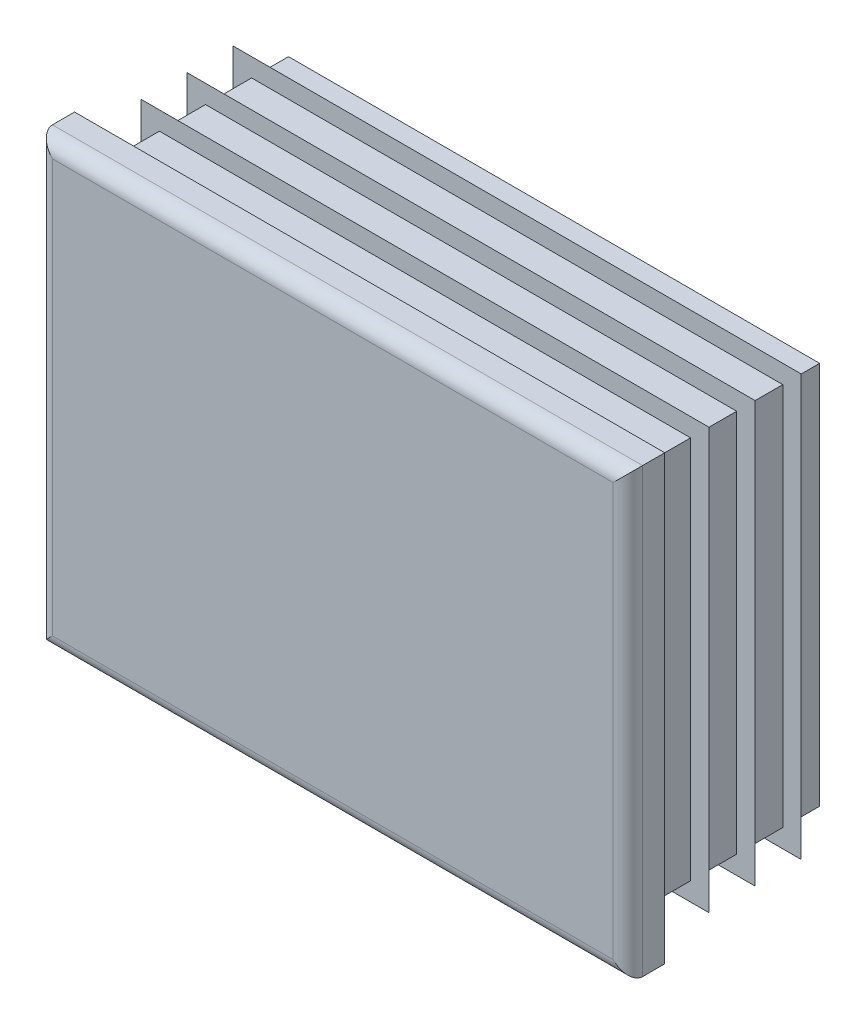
ISO-10303-21;
HEADER;
FILE_DESCRIPTION(('STEP AP214'),'2;1');
FILE_NAME('part.step','',(''),(''),'','','');
FILE_SCHEMA(('AUTOMOTIVE_DESIGN { 1 0 10303 214 1 1 1 1 }'));
ENDSEC;
DATA;
#1=APPLICATION_CONTEXT('core data for automotive mechanical design processes');
#2=APPLICATION_PROTOCOL_DEFINITION('international standard','automotive_design',2000,#1);
#3=PRODUCT_CONTEXT('',#1,'mechanical');
#4=PRODUCT('Part','Part','',(#3));
#5=PRODUCT_RELATED_PRODUCT_CATEGORY('part','',(#4));
#6=PRODUCT_DEFINITION_FORMATION('','',#4);
#7=PRODUCT_DEFINITION_CONTEXT('part definition',#1,'design');
#8=PRODUCT_DEFINITION('design','',#6,#7);
#9=PRODUCT_DEFINITION_SHAPE('','',#8);
#10=(LENGTH_UNIT() NAMED_UNIT(*) SI_UNIT(.MILLI.,.METRE.));
#11=(NAMED_UNIT(*) PLANE_ANGLE_UNIT() SI_UNIT($,.RADIAN.));
#12=(NAMED_UNIT(*) SI_UNIT($,.STERADIAN.) SOLID_ANGLE_UNIT());
#13=UNCERTAINTY_MEASURE_WITH_UNIT(LENGTH_MEASURE(1.E-05),#10,'distance_accuracy_value','');
#14=(GEOMETRIC_REPRESENTATION_CONTEXT(3) GLOBAL_UNCERTAINTY_ASSIGNED_CONTEXT((#13)) GLOBAL_UNIT_ASSIGNED_CONTEXT((#10,
#11,#12)) REPRESENTATION_CONTEXT('',''));
#15=CARTESIAN_POINT('',(0.,0.,0.));
#16=DIRECTION('',(0.,0.,1.));
#17=DIRECTION('',(1.,0.,0.));
#18=AXIS2_PLACEMENT_3D('',#15,#16,#17);
#19=CARTESIAN_POINT('',(38.,-30.,5.));
#20=DIRECTION('',(0.,0.,-1.));
#21=DIRECTION('',(0.,1.,0.));
#22=AXIS2_PLACEMENT_3D('',#19,#20,#21);
#23=PLANE('',#22);
#24=DIRECTION('',(0.,1.,0.));
#25=VECTOR('',#24,1.);
#26=CARTESIAN_POINT('',(-38.,-30.,5.));
#27=LINE('',#26,#25);
#28=CARTESIAN_POINT('',(-38.,-28.,5.));
#29=VERTEX_POINT('',#28);
#30=CARTESIAN_POINT('',(-38.,28.,5.));
#31=VERTEX_POINT('',#30);
#32=EDGE_CURVE('E310',#29,#31,#27,.T.);
#33=ORIENTED_EDGE('',*,*,#32,.F.);
#34=DIRECTION('',(-1.,0.,0.));
#35=VECTOR('',#34,1.);
#36=CARTESIAN_POINT('',(40.,-28.,5.));
#37=LINE('',#36,#35);
#38=CARTESIAN_POINT('',(38.,-28.,5.));
#39=VERTEX_POINT('',#38);
#40=EDGE_CURVE('E482',#39,#29,#37,.T.);
#41=ORIENTED_EDGE('',*,*,#40,.F.);
#42=DIRECTION('',(0.,1.,0.));
#43=VECTOR('',#42,1.);
#44=CARTESIAN_POINT('',(38.,-30.,5.));
#45=LINE('',#44,#43);
#46=CARTESIAN_POINT('',(38.,28.,5.));
#47=VERTEX_POINT('',#46);
#48=EDGE_CURVE('E305',#39,#47,#45,.T.);
#49=ORIENTED_EDGE('',*,*,#48,.T.);
#50=DIRECTION('',(-1.,0.,0.));
#51=VECTOR('',#50,1.);
#52=CARTESIAN_POINT('',(40.,28.,5.));
#53=LINE('',#52,#51);
#54=EDGE_CURVE('E630',#47,#31,#53,.T.);
#55=ORIENTED_EDGE('',*,*,#54,.T.);
#56=EDGE_LOOP('',(#33,#41,#49,#55));
#57=FACE_BOUND('',#56,.T.);
#58=ADVANCED_FACE('F14',(#57),#23,.F.);
#59=CARTESIAN_POINT('',(-38.,-30.,3.));
#60=DIRECTION('',(0.,1.,0.));
#61=DIRECTION('',(-1.,0.,0.));
#62=AXIS2_PLACEMENT_3D('',#59,#60,#61);
#63=CYLINDRICAL_SURFACE('',#62,2.);
#64=DIRECTION('',(0.,1.,0.));
#65=VECTOR('',#64,1.);
#66=CARTESIAN_POINT('',(-40.,-30.,3.));
#67=LINE('',#66,#65);
#68=CARTESIAN_POINT('',(-40.,-30.,3.));
#69=VERTEX_POINT('',#68);
#70=CARTESIAN_POINT('',(-40.,30.,3.));
#71=VERTEX_POINT('',#70);
#72=EDGE_CURVE('E402',#69,#71,#67,.T.);
#73=ORIENTED_EDGE('',*,*,#72,.F.);
#74=CARTESIAN_POINT('',(-38.,-28.,3.));
#75=DIRECTION('',(-0.707106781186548,0.707106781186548,0.));
#76=DIRECTION('',(0.707106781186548,0.707106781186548,0.));
#77=AXIS2_PLACEMENT_3D('',#74,#75,#76);
#78=ELLIPSE('',#77,2.82842712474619,2.);
#79=EDGE_CURVE('E59',#69,#29,#78,.T.);
#80=ORIENTED_EDGE('',*,*,#79,.T.);
#81=ORIENTED_EDGE('',*,*,#32,.T.);
#82=CARTESIAN_POINT('',(-38.,28.,3.));
#83=DIRECTION('',(0.707106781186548,0.707106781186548,0.));
#84=DIRECTION('',(-0.707106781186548,0.707106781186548,0.));
#85=AXIS2_PLACEMENT_3D('',#82,#83,#84);
#86=ELLIPSE('',#85,2.82842712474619,2.);
#87=EDGE_CURVE('E306',#31,#71,#86,.F.);
#88=ORIENTED_EDGE('',*,*,#87,.T.);
#89=EDGE_LOOP('',(#73,#80,#81,#88));
#90=FACE_BOUND('',#89,.T.);
#91=ADVANCED_FACE('F16',(#90),#63,.T.);
#92=CARTESIAN_POINT('',(-40.,-30.,3.));
#93=DIRECTION('',(1.,0.,0.));
#94=DIRECTION('',(0.,1.,0.));
#95=AXIS2_PLACEMENT_3D('',#92,#93,#94);
#96=PLANE('',#95);
#97=DIRECTION('',(0.,0.,-1.));
#98=VECTOR('',#97,1.);
#99=CARTESIAN_POINT('',(-40.,30.,3.));
#100=LINE('',#99,#98);
#101=CARTESIAN_POINT('',(-40.,30.,0.));
#102=VERTEX_POINT('',#101);
#103=EDGE_CURVE('E615',#71,#102,#100,.T.);
#104=ORIENTED_EDGE('',*,*,#103,.T.);
#105=DIRECTION('',(0.,1.,0.));
#106=VECTOR('',#105,1.);
#107=CARTESIAN_POINT('',(-40.,-30.,0.));
#108=LINE('',#107,#106);
#109=CARTESIAN_POINT('',(-40.,-30.,0.));
#110=VERTEX_POINT('',#109);
#111=EDGE_CURVE('E400',#110,#102,#108,.T.);
#112=ORIENTED_EDGE('',*,*,#111,.F.);
#113=DIRECTION('',(0.,0.,-1.));
#114=VECTOR('',#113,1.);
#115=CARTESIAN_POINT('',(-40.,-30.,3.));
#116=LINE('',#115,#114);
#117=EDGE_CURVE('E616',#69,#110,#116,.T.);
#118=ORIENTED_EDGE('',*,*,#117,.F.);
#119=ORIENTED_EDGE('',*,*,#72,.T.);
#120=EDGE_LOOP('',(#104,#112,#118,#119));
#121=FACE_BOUND('',#120,.T.);
#122=ADVANCED_FACE('F697',(#121),#96,.F.);
#123=CARTESIAN_POINT('',(-36.,-30.,0.));
#124=DIRECTION('',(1.,0.,0.));
#125=DIRECTION('',(0.,1.,0.));
#126=AXIS2_PLACEMENT_3D('',#123,#124,#125);
#127=PLANE('',#126);
#128=DIRECTION('',(0.,1.,0.));
#129=VECTOR('',#128,1.);
#130=CARTESIAN_POINT('',(-36.,-30.,0.));
#131=LINE('',#130,#129);
#132=CARTESIAN_POINT('',(-36.,-26.,0.));
#133=VERTEX_POINT('',#132);
#134=CARTESIAN_POINT('',(-36.,26.,0.));
#135=VERTEX_POINT('',#134);
#136=EDGE_CURVE('E397',#133,#135,#131,.T.);
#137=ORIENTED_EDGE('',*,*,#136,.T.);
#138=DIRECTION('',(0.,0.,-1.));
#139=VECTOR('',#138,1.);
#140=CARTESIAN_POINT('',(-36.,26.,0.));
#141=LINE('',#140,#139);
#142=CARTESIAN_POINT('',(-36.,26.,-1.25));
#143=VERTEX_POINT('',#142);
#144=EDGE_CURVE('E495',#135,#143,#141,.T.);
#145=ORIENTED_EDGE('',*,*,#144,.T.);
#146=DIRECTION('',(0.,1.,0.));
#147=VECTOR('',#146,1.);
#148=CARTESIAN_POINT('',(-36.,-30.,-1.25));
#149=LINE('',#148,#147);
#150=CARTESIAN_POINT('',(-36.,-26.,-1.25));
#151=VERTEX_POINT('',#150);
#152=EDGE_CURVE('E394',#151,#143,#149,.T.);
#153=ORIENTED_EDGE('',*,*,#152,.F.);
#154=DIRECTION('',(0.,0.,1.));
#155=VECTOR('',#154,1.);
#156=CARTESIAN_POINT('',(-36.,-26.,0.));
#157=LINE('',#156,#155);
#158=EDGE_CURVE('E489',#151,#133,#157,.T.);
#159=ORIENTED_EDGE('',*,*,#158,.T.);
#160=EDGE_LOOP('',(#137,#145,#153,#159));
#161=FACE_BOUND('',#160,.T.);
#162=ADVANCED_FACE('F787',(#161),#127,.F.);
#163=CARTESIAN_POINT('',(-38.5,-30.,-1.25));
#164=DIRECTION('',(0.342020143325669,0.,0.939692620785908));
#165=DIRECTION('',(-0.939692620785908,0.,0.342020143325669));
#166=AXIS2_PLACEMENT_3D('',#163,#164,#165);
#167=PLANE('',#166);
#168=DIRECTION('',(0.,1.,0.));
#169=VECTOR('',#168,1.);
#170=CARTESIAN_POINT('',(-38.5,-30.,-1.25));
#171=LINE('',#170,#169);
#172=CARTESIAN_POINT('',(-38.5,-28.5,-1.25));
#173=VERTEX_POINT('',#172);
#174=CARTESIAN_POINT('',(-38.5,28.5,-1.25));
#175=VERTEX_POINT('',#174);
#176=EDGE_CURVE('E392',#173,#175,#171,.T.);
#177=ORIENTED_EDGE('',*,*,#176,.T.);
#178=DIRECTION('',(0.844349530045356,-0.438895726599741,-0.307318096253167));
#179=VECTOR('',#178,1.);
#180=CARTESIAN_POINT('',(-16.8209880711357,17.2311766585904,-9.14051505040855));
#181=LINE('',#180,#179);
#182=CARTESIAN_POINT('',(-36.,27.2004915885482,-2.1599255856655));
#183=VERTEX_POINT('',#182);
#184=EDGE_CURVE('E519',#175,#183,#181,.T.);
#185=ORIENTED_EDGE('',*,*,#184,.T.);
#186=DIRECTION('',(0.,1.,0.));
#187=VECTOR('',#186,1.);
#188=CARTESIAN_POINT('',(-36.,-30.,-2.1599255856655));
#189=LINE('',#188,#187);
#190=CARTESIAN_POINT('',(-36.,-27.2004915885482,-2.1599255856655));
#191=VERTEX_POINT('',#190);
#192=EDGE_CURVE('E389',#191,#183,#189,.T.);
#193=ORIENTED_EDGE('',*,*,#192,.F.);
#194=DIRECTION('',(-0.844349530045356,-0.438895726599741,0.307318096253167));
#195=VECTOR('',#194,1.);
#196=CARTESIAN_POINT('',(-39.0558721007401,-28.7889441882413,-1.04767910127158));
#197=LINE('',#196,#195);
#198=EDGE_CURVE('E507',#191,#173,#197,.T.);
#199=ORIENTED_EDGE('',*,*,#198,.T.);
#200=EDGE_LOOP('',(#177,#185,#193,#199));
#201=FACE_BOUND('',#200,.T.);
#202=ADVANCED_FACE('F783',(#201),#167,.F.);
#203=CARTESIAN_POINT('',(-36.,-30.,-2.1599255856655));
#204=DIRECTION('',(1.,0.,0.));
#205=DIRECTION('',(0.,1.,0.));
#206=AXIS2_PLACEMENT_3D('',#203,#204,#205);
#207=PLANE('',#206);
#208=ORIENTED_EDGE('',*,*,#192,.T.);
#209=DIRECTION('',(0.,-0.819152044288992,-0.573576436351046));
#210=VECTOR('',#209,1.);
#211=CARTESIAN_POINT('',(-36.,-11.1816143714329,-29.0353655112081));
#212=LINE('',#211,#210);
#213=CARTESIAN_POINT('',(-36.,26.,-3.00051884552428));
#214=VERTEX_POINT('',#213);
#215=EDGE_CURVE('E516',#183,#214,#212,.T.);
#216=ORIENTED_EDGE('',*,*,#215,.T.);
#217=DIRECTION('',(0.,0.,-1.));
#218=VECTOR('',#217,1.);
#219=CARTESIAN_POINT('',(-36.,26.,-2.1599255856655));
#220=LINE('',#219,#218);
#221=CARTESIAN_POINT('',(-36.,26.,-7.5));
#222=VERTEX_POINT('',#221);
#223=EDGE_CURVE('E525',#214,#222,#220,.T.);
#224=ORIENTED_EDGE('',*,*,#223,.T.);
#225=DIRECTION('',(0.,1.,0.));
#226=VECTOR('',#225,1.);
#227=CARTESIAN_POINT('',(-36.,-30.,-7.5));
#228=LINE('',#227,#226);
#229=CARTESIAN_POINT('',(-36.,-26.,-7.5));
#230=VERTEX_POINT('',#229);
#231=EDGE_CURVE('E386',#230,#222,#228,.T.);
#232=ORIENTED_EDGE('',*,*,#231,.F.);
#233=DIRECTION('',(0.,0.,1.));
#234=VECTOR('',#233,1.);
#235=CARTESIAN_POINT('',(-36.,-26.,-2.1599255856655));
#236=LINE('',#235,#234);
#237=CARTESIAN_POINT('',(-36.,-26.,-3.00051884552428));
#238=VERTEX_POINT('',#237);
#239=EDGE_CURVE('E522',#230,#238,#236,.T.);
#240=ORIENTED_EDGE('',*,*,#239,.T.);
#241=DIRECTION('',(0.,-0.819152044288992,0.573576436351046));
#242=VECTOR('',#241,1.);
#243=CARTESIAN_POINT('',(-36.,-29.0789899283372,-0.844586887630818));
#244=LINE('',#243,#242);
#245=EDGE_CURVE('E504',#238,#191,#244,.T.);
#246=ORIENTED_EDGE('',*,*,#245,.T.);
#247=EDGE_LOOP('',(#208,#216,#224,#232,#240,#246));
#248=FACE_BOUND('',#247,.T.);
#249=ADVANCED_FACE('F779',(#248),#207,.F.);
#250=CARTESIAN_POINT('',(-38.5,-30.,-7.5));
#251=DIRECTION('',(0.342020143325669,0.,0.939692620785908));
#252=DIRECTION('',(-0.939692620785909,0.,0.342020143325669));
#253=AXIS2_PLACEMENT_3D('',#250,#251,#252);
#254=PLANE('',#253);
#255=DIRECTION('',(0.,1.,0.));
#256=VECTOR('',#255,1.);
#257=CARTESIAN_POINT('',(-38.5,-30.,-7.5));
#258=LINE('',#257,#256);
#259=CARTESIAN_POINT('',(-38.5,-28.5,-7.5));
#260=VERTEX_POINT('',#259);
#261=CARTESIAN_POINT('',(-38.5,28.5,-7.5));
#262=VERTEX_POINT('',#261);
#263=EDGE_CURVE('E384',#260,#262,#258,.T.);
#264=ORIENTED_EDGE('',*,*,#263,.T.);
#265=DIRECTION('',(0.844349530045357,-0.438895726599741,-0.307318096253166));
#266=VECTOR('',#265,1.);
#267=CARTESIAN_POINT('',(-16.8209880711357,17.2311766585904,-15.3905150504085));
#268=LINE('',#267,#266);
#269=CARTESIAN_POINT('',(-36.,27.2004915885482,-8.40992558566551));
#270=VERTEX_POINT('',#269);
#271=EDGE_CURVE('E549',#262,#270,#268,.T.);
#272=ORIENTED_EDGE('',*,*,#271,.T.);
#273=DIRECTION('',(0.,1.,0.));
#274=VECTOR('',#273,1.);
#275=CARTESIAN_POINT('',(-36.,-30.,-8.4099255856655));
#276=LINE('',#275,#274);
#277=CARTESIAN_POINT('',(-36.,-27.2004915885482,-8.4099255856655));
#278=VERTEX_POINT('',#277);
#279=EDGE_CURVE('E381',#278,#270,#276,.T.);
#280=ORIENTED_EDGE('',*,*,#279,.F.);
#281=DIRECTION('',(-0.844349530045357,-0.438895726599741,0.307318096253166));
#282=VECTOR('',#281,1.);
#283=CARTESIAN_POINT('',(-39.0558721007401,-28.7889441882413,-7.29767910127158));
#284=LINE('',#283,#282);
#285=EDGE_CURVE('E537',#278,#260,#284,.T.);
#286=ORIENTED_EDGE('',*,*,#285,.T.);
#287=EDGE_LOOP('',(#264,#272,#280,#286));
#288=FACE_BOUND('',#287,.T.);
#289=ADVANCED_FACE('F775',(#288),#254,.F.);
#290=CARTESIAN_POINT('',(-36.,-30.,-8.4099255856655));
#291=DIRECTION('',(1.,0.,0.));
#292=DIRECTION('',(0.,1.,0.));
#293=AXIS2_PLACEMENT_3D('',#290,#291,#292);
#294=PLANE('',#293);
#295=ORIENTED_EDGE('',*,*,#279,.T.);
#296=DIRECTION('',(0.,-0.819152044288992,-0.573576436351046));
#297=VECTOR('',#296,1.);
#298=CARTESIAN_POINT('',(-36.,-11.1816143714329,-35.285365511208));
#299=LINE('',#298,#297);
#300=CARTESIAN_POINT('',(-36.,26.,-9.25051884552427));
#301=VERTEX_POINT('',#300);
#302=EDGE_CURVE('E546',#270,#301,#299,.T.);
#303=ORIENTED_EDGE('',*,*,#302,.T.);
#304=DIRECTION('',(0.,0.,-1.));
#305=VECTOR('',#304,1.);
#306=CARTESIAN_POINT('',(-36.,26.,-8.4099255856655));
#307=LINE('',#306,#305);
#308=CARTESIAN_POINT('',(-36.,26.,-13.75));
#309=VERTEX_POINT('',#308);
#310=EDGE_CURVE('E555',#301,#309,#307,.T.);
#311=ORIENTED_EDGE('',*,*,#310,.T.);
#312=DIRECTION('',(0.,1.,0.));
#313=VECTOR('',#312,1.);
#314=CARTESIAN_POINT('',(-36.,-30.,-13.75));
#315=LINE('',#314,#313);
#316=CARTESIAN_POINT('',(-36.,-26.,-13.75));
#317=VERTEX_POINT('',#316);
#318=EDGE_CURVE('E378',#317,#309,#315,.T.);
#319=ORIENTED_EDGE('',*,*,#318,.F.);
#320=DIRECTION('',(0.,0.,1.));
#321=VECTOR('',#320,1.);
#322=CARTESIAN_POINT('',(-36.,-26.,-8.4099255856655));
#323=LINE('',#322,#321);
#324=CARTESIAN_POINT('',(-36.,-26.,-9.25051884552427));
#325=VERTEX_POINT('',#324);
#326=EDGE_CURVE('E552',#317,#325,#323,.T.);
#327=ORIENTED_EDGE('',*,*,#326,.T.);
#328=DIRECTION('',(0.,-0.819152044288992,0.573576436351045));
#329=VECTOR('',#328,1.);
#330=CARTESIAN_POINT('',(-36.,-29.0789899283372,-7.09458688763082));
#331=LINE('',#330,#329);
#332=EDGE_CURVE('E534',#325,#278,#331,.T.);
#333=ORIENTED_EDGE('',*,*,#332,.T.);
#334=EDGE_LOOP('',(#295,#303,#311,#319,#327,#333));
#335=FACE_BOUND('',#334,.T.);
#336=ADVANCED_FACE('F771',(#335),#294,.F.);
#337=CARTESIAN_POINT('',(-38.5,-30.,-13.75));
#338=DIRECTION('',(0.342020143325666,0.,0.939692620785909));
#339=DIRECTION('',(-0.939692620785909,0.,0.342020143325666));
#340=AXIS2_PLACEMENT_3D('',#337,#338,#339);
#341=PLANE('',#340);
#342=DIRECTION('',(0.,1.,0.));
#343=VECTOR('',#342,1.);
#344=CARTESIAN_POINT('',(-38.5,-30.,-13.75));
#345=LINE('',#344,#343);
#346=CARTESIAN_POINT('',(-38.5,-28.5,-13.75));
#347=VERTEX_POINT('',#346);
#348=CARTESIAN_POINT('',(-38.5,28.5,-13.75));
#349=VERTEX_POINT('',#348);
#350=EDGE_CURVE('E376',#347,#349,#345,.T.);
#351=ORIENTED_EDGE('',*,*,#350,.T.);
#352=DIRECTION('',(0.844349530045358,-0.438895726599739,-0.307318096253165));
#353=VECTOR('',#352,1.);
#354=CARTESIAN_POINT('',(-16.8209880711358,17.2311766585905,-21.6405150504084));
#355=LINE('',#354,#353);
#356=CARTESIAN_POINT('',(-36.,27.2004915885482,-14.6599255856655));
#357=VERTEX_POINT('',#356);
#358=EDGE_CURVE('E579',#349,#357,#355,.T.);
#359=ORIENTED_EDGE('',*,*,#358,.T.);
#360=DIRECTION('',(0.,1.,0.));
#361=VECTOR('',#360,1.);
#362=CARTESIAN_POINT('',(-36.,-30.,-14.6599255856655));
#363=LINE('',#362,#361);
#364=CARTESIAN_POINT('',(-36.,-27.2004915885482,-14.6599255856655));
#365=VERTEX_POINT('',#364);
#366=EDGE_CURVE('E373',#365,#357,#363,.T.);
#367=ORIENTED_EDGE('',*,*,#366,.F.);
#368=DIRECTION('',(-0.844349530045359,-0.438895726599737,0.307318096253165));
#369=VECTOR('',#368,1.);
#370=CARTESIAN_POINT('',(-39.0558721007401,-28.7889441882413,-13.5476791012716));
#371=LINE('',#370,#369);
#372=EDGE_CURVE('E567',#365,#347,#371,.T.);
#373=ORIENTED_EDGE('',*,*,#372,.T.);
#374=EDGE_LOOP('',(#351,#359,#367,#373));
#375=FACE_BOUND('',#374,.T.);
#376=ADVANCED_FACE('F767',(#375),#341,.F.);
#377=CARTESIAN_POINT('',(-36.,-30.,-14.6599255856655));
#378=DIRECTION('',(1.,0.,0.));
#379=DIRECTION('',(0.,1.,0.));
#380=AXIS2_PLACEMENT_3D('',#377,#378,#379);
#381=PLANE('',#380);
#382=ORIENTED_EDGE('',*,*,#366,.T.);
#383=DIRECTION('',(0.,-0.819152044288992,-0.573576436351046));
#384=VECTOR('',#383,1.);
#385=CARTESIAN_POINT('',(-36.,-11.1816143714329,-41.535365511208));
#386=LINE('',#385,#384);
#387=CARTESIAN_POINT('',(-36.,26.,-15.5005188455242));
#388=VERTEX_POINT('',#387);
#389=EDGE_CURVE('E576',#357,#388,#386,.T.);
#390=ORIENTED_EDGE('',*,*,#389,.T.);
#391=DIRECTION('',(0.,0.,-1.));
#392=VECTOR('',#391,1.);
#393=CARTESIAN_POINT('',(-36.,26.,-14.6599255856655));
#394=LINE('',#393,#392);
#395=CARTESIAN_POINT('',(-36.,26.,-20.));
#396=VERTEX_POINT('',#395);
#397=EDGE_CURVE('E585',#388,#396,#394,.T.);
#398=ORIENTED_EDGE('',*,*,#397,.T.);
#399=DIRECTION('',(0.,1.,0.));
#400=VECTOR('',#399,1.);
#401=CARTESIAN_POINT('',(-36.,-30.,-20.));
#402=LINE('',#401,#400);
#403=CARTESIAN_POINT('',(-36.,-26.,-20.));
#404=VERTEX_POINT('',#403);
#405=EDGE_CURVE('E370',#404,#396,#402,.T.);
#406=ORIENTED_EDGE('',*,*,#405,.F.);
#407=DIRECTION('',(0.,0.,1.));
#408=VECTOR('',#407,1.);
#409=CARTESIAN_POINT('',(-36.,-26.,-14.6599255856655));
#410=LINE('',#409,#408);
#411=CARTESIAN_POINT('',(-36.,-26.,-15.5005188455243));
#412=VERTEX_POINT('',#411);
#413=EDGE_CURVE('E582',#404,#412,#410,.T.);
#414=ORIENTED_EDGE('',*,*,#413,.T.);
#415=DIRECTION('',(0.,-0.819152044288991,0.573576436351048));
#416=VECTOR('',#415,1.);
#417=CARTESIAN_POINT('',(-36.,-29.0789899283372,-13.3445868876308));
#418=LINE('',#417,#416);
#419=EDGE_CURVE('E564',#412,#365,#418,.T.);
#420=ORIENTED_EDGE('',*,*,#419,.T.);
#421=EDGE_LOOP('',(#382,#390,#398,#406,#414,#420));
#422=FACE_BOUND('',#421,.T.);
#423=ADVANCED_FACE('F764',(#422),#381,.F.);
#424=CARTESIAN_POINT('',(-38.5,-30.,-20.));
#425=DIRECTION('',(0.342020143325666,0.,0.939692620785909));
#426=DIRECTION('',(-0.939692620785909,0.,0.342020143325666));
#427=AXIS2_PLACEMENT_3D('',#424,#425,#426);
#428=PLANE('',#427);
#429=DIRECTION('',(0.,1.,0.));
#430=VECTOR('',#429,1.);
#431=CARTESIAN_POINT('',(-38.5,-30.,-20.));
#432=LINE('',#431,#430);
#433=CARTESIAN_POINT('',(-38.5,-28.5,-20.));
#434=VERTEX_POINT('',#433);
#435=CARTESIAN_POINT('',(-38.5,28.5,-20.));
#436=VERTEX_POINT('',#435);
#437=EDGE_CURVE('E368',#434,#436,#432,.T.);
#438=ORIENTED_EDGE('',*,*,#437,.T.);
#439=DIRECTION('',(0.844349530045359,-0.438895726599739,-0.307318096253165));
#440=VECTOR('',#439,1.);
#441=CARTESIAN_POINT('',(-16.8209880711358,17.2311766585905,-27.8905150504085));
#442=LINE('',#441,#440);
#443=CARTESIAN_POINT('',(-36.,27.2004915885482,-20.9099255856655));
#444=VERTEX_POINT('',#443);
#445=EDGE_CURVE('E607',#436,#444,#442,.T.);
#446=ORIENTED_EDGE('',*,*,#445,.T.);
#447=DIRECTION('',(0.,1.,0.));
#448=VECTOR('',#447,1.);
#449=CARTESIAN_POINT('',(-36.,-30.,-20.9099255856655));
#450=LINE('',#449,#448);
#451=CARTESIAN_POINT('',(-36.,-27.2004915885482,-20.9099255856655));
#452=VERTEX_POINT('',#451);
#453=EDGE_CURVE('E365',#452,#444,#450,.T.);
#454=ORIENTED_EDGE('',*,*,#453,.F.);
#455=DIRECTION('',(-0.844349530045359,-0.438895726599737,0.307318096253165));
#456=VECTOR('',#455,1.);
#457=CARTESIAN_POINT('',(-39.0558721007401,-28.7889441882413,-19.7976791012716));
#458=LINE('',#457,#456);
#459=EDGE_CURVE('E595',#452,#434,#458,.T.);
#460=ORIENTED_EDGE('',*,*,#459,.T.);
#461=EDGE_LOOP('',(#438,#446,#454,#460));
#462=FACE_BOUND('',#461,.T.);
#463=ADVANCED_FACE('F675',(#462),#428,.F.);
#464=CARTESIAN_POINT('',(-36.,-30.,-20.9099255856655));
#465=DIRECTION('',(1.,0.,0.));
#466=DIRECTION('',(0.,1.,0.));
#467=AXIS2_PLACEMENT_3D('',#464,#465,#466);
#468=PLANE('',#467);
#469=ORIENTED_EDGE('',*,*,#453,.T.);
#470=DIRECTION('',(0.,-0.819152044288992,-0.573576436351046));
#471=VECTOR('',#470,1.);
#472=CARTESIAN_POINT('',(-36.,-11.1816143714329,-47.7853655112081));
#473=LINE('',#472,#471);
#474=CARTESIAN_POINT('',(-36.,26.,-21.7505188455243));
#475=VERTEX_POINT('',#474);
#476=EDGE_CURVE('E604',#444,#475,#473,.T.);
#477=ORIENTED_EDGE('',*,*,#476,.T.);
#478=DIRECTION('',(0.,0.,-1.));
#479=VECTOR('',#478,1.);
#480=CARTESIAN_POINT('',(-36.,26.,-20.9099255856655));
#481=LINE('',#480,#479);
#482=CARTESIAN_POINT('',(-36.,26.,-25.));
#483=VERTEX_POINT('',#482);
#484=EDGE_CURVE('E613',#475,#483,#481,.T.);
#485=ORIENTED_EDGE('',*,*,#484,.T.);
#486=DIRECTION('',(0.,1.,0.));
#487=VECTOR('',#486,1.);
#488=CARTESIAN_POINT('',(-36.,-30.,-25.));
#489=LINE('',#488,#487);
#490=CARTESIAN_POINT('',(-36.,-26.,-25.));
#491=VERTEX_POINT('',#490);
#492=EDGE_CURVE('E362',#491,#483,#489,.T.);
#493=ORIENTED_EDGE('',*,*,#492,.F.);
#494=DIRECTION('',(0.,0.,1.));
#495=VECTOR('',#494,1.);
#496=CARTESIAN_POINT('',(-36.,-26.,-20.9099255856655));
#497=LINE('',#496,#495);
#498=CARTESIAN_POINT('',(-36.,-26.,-21.7505188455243));
#499=VERTEX_POINT('',#498);
#500=EDGE_CURVE('E610',#491,#499,#497,.T.);
#501=ORIENTED_EDGE('',*,*,#500,.T.);
#502=DIRECTION('',(0.,-0.819152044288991,0.573576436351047));
#503=VECTOR('',#502,1.);
#504=CARTESIAN_POINT('',(-36.,-29.0789899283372,-19.5945868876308));
#505=LINE('',#504,#503);
#506=EDGE_CURVE('E592',#499,#452,#505,.T.);
#507=ORIENTED_EDGE('',*,*,#506,.T.);
#508=EDGE_LOOP('',(#469,#477,#485,#493,#501,#507));
#509=FACE_BOUND('',#508,.T.);
#510=ADVANCED_FACE('F677',(#509),#468,.F.);
#511=CARTESIAN_POINT('',(-36.,-30.,-25.));
#512=DIRECTION('',(0.,0.,1.));
#513=DIRECTION('',(0.,-1.,0.));
#514=AXIS2_PLACEMENT_3D('',#511,#512,#513);
#515=PLANE('',#514);
#516=ORIENTED_EDGE('',*,*,#492,.T.);
#517=DIRECTION('',(-1.,0.,0.));
#518=VECTOR('',#517,1.);
#519=CARTESIAN_POINT('',(40.,26.,-25.));
#520=LINE('',#519,#518);
#521=CARTESIAN_POINT('',(36.,26.,-25.));
#522=VERTEX_POINT('',#521);
#523=EDGE_CURVE('E438',#522,#483,#520,.T.);
#524=ORIENTED_EDGE('',*,*,#523,.F.);
#525=DIRECTION('',(0.,1.,0.));
#526=VECTOR('',#525,1.);
#527=CARTESIAN_POINT('',(36.,-30.,-25.));
#528=LINE('',#527,#526);
#529=CARTESIAN_POINT('',(36.,-26.,-25.));
#530=VERTEX_POINT('',#529);
#531=EDGE_CURVE('E359',#530,#522,#528,.T.);
#532=ORIENTED_EDGE('',*,*,#531,.F.);
#533=DIRECTION('',(-1.,0.,0.));
#534=VECTOR('',#533,1.);
#535=CARTESIAN_POINT('',(40.,-26.,-25.));
#536=LINE('',#535,#534);
#537=EDGE_CURVE('E436',#530,#491,#536,.T.);
#538=ORIENTED_EDGE('',*,*,#537,.T.);
#539=EDGE_LOOP('',(#516,#524,#532,#538));
#540=FACE_BOUND('',#539,.T.);
#541=ADVANCED_FACE('F435',(#540),#515,.F.);
#542=CARTESIAN_POINT('',(36.,-30.,-25.));
#543=DIRECTION('',(-1.,0.,0.));
#544=DIRECTION('',(0.,-1.,0.));
#545=AXIS2_PLACEMENT_3D('',#542,#543,#544);
#546=PLANE('',#545);
#547=DIRECTION('',(0.,0.,1.));
#548=VECTOR('',#547,1.);
#549=CARTESIAN_POINT('',(36.,26.,-25.));
#550=LINE('',#549,#548);
#551=CARTESIAN_POINT('',(36.,26.,-21.7505188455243));
#552=VERTEX_POINT('',#551);
#553=EDGE_CURVE('E9',#522,#552,#550,.T.);
#554=ORIENTED_EDGE('',*,*,#553,.T.);
#555=DIRECTION('',(0.,0.819152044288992,0.573576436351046));
#556=VECTOR('',#555,1.);
#557=CARTESIAN_POINT('',(36.,-13.1033207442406,-49.1309587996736));
#558=LINE('',#557,#556);
#559=CARTESIAN_POINT('',(36.,27.2004915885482,-20.9099255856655));
#560=VERTEX_POINT('',#559);
#561=EDGE_CURVE('E601',#552,#560,#558,.T.);
#562=ORIENTED_EDGE('',*,*,#561,.T.);
#563=DIRECTION('',(0.,1.,0.));
#564=VECTOR('',#563,1.);
#565=CARTESIAN_POINT('',(36.,-30.,-20.9099255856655));
#566=LINE('',#565,#564);
#567=CARTESIAN_POINT('',(36.,-27.2004915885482,-20.9099255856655));
#568=VERTEX_POINT('',#567);
#569=EDGE_CURVE('E356',#568,#560,#566,.T.);
#570=ORIENTED_EDGE('',*,*,#569,.F.);
#571=DIRECTION('',(0.,0.819152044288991,-0.573576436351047));
#572=VECTOR('',#571,1.);
#573=CARTESIAN_POINT('',(36.,-27.1572835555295,-20.9401801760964));
#574=LINE('',#573,#572);
#575=CARTESIAN_POINT('',(36.,-26.,-21.7505188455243));
#576=VERTEX_POINT('',#575);
#577=EDGE_CURVE('E428',#568,#576,#574,.T.);
#578=ORIENTED_EDGE('',*,*,#577,.T.);
#579=DIRECTION('',(0.,0.,-1.));
#580=VECTOR('',#579,1.);
#581=CARTESIAN_POINT('',(36.,-26.,-25.));
#582=LINE('',#581,#580);
#583=EDGE_CURVE('E23',#576,#530,#582,.T.);
#584=ORIENTED_EDGE('',*,*,#583,.T.);
#585=ORIENTED_EDGE('',*,*,#531,.T.);
#586=EDGE_LOOP('',(#554,#562,#570,#578,#584,#585));
#587=FACE_BOUND('',#586,.T.);
#588=ADVANCED_FACE('F426',(#587),#546,.F.);
#589=CARTESIAN_POINT('',(36.,-30.,-20.9099255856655));
#590=DIRECTION('',(-0.342020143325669,0.,0.939692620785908));
#591=DIRECTION('',(-0.939692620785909,0.,-0.342020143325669));
#592=AXIS2_PLACEMENT_3D('',#589,#590,#591);
#593=PLANE('',#592);
#594=ORIENTED_EDGE('',*,*,#569,.T.);
#595=DIRECTION('',(0.844349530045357,0.438895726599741,0.307318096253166));
#596=VECTOR('',#595,1.);
#597=CARTESIAN_POINT('',(14.8025617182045,16.1819918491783,-28.625162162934));
#598=LINE('',#597,#596);
#599=CARTESIAN_POINT('',(38.5,28.5,-20.));
#600=VERTEX_POINT('',#599);
#601=EDGE_CURVE('E598',#560,#600,#598,.T.);
#602=ORIENTED_EDGE('',*,*,#601,.T.);
#603=DIRECTION('',(0.,1.,0.));
#604=VECTOR('',#603,1.);
#605=CARTESIAN_POINT('',(38.5,-30.,-20.));
#606=LINE('',#605,#604);
#607=CARTESIAN_POINT('',(38.5,-28.5,-20.));
#608=VERTEX_POINT('',#607);
#609=EDGE_CURVE('E353',#608,#600,#606,.T.);
#610=ORIENTED_EDGE('',*,*,#609,.F.);
#611=DIRECTION('',(-0.844349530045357,0.43889572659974,-0.307318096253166));
#612=VECTOR('',#611,1.);
#613=CARTESIAN_POINT('',(37.0374457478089,-27.7397593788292,-20.532326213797));
#614=LINE('',#613,#612);
#615=EDGE_CURVE('E588',#608,#568,#614,.T.);
#616=ORIENTED_EDGE('',*,*,#615,.T.);
#617=EDGE_LOOP('',(#594,#602,#610,#616));
#618=FACE_BOUND('',#617,.T.);
#619=ADVANCED_FACE('F752',(#618),#593,.F.);
#620=CARTESIAN_POINT('',(38.5,-30.,-20.));
#621=DIRECTION('',(0.,0.,-1.));
#622=DIRECTION('',(0.,1.,0.));
#623=AXIS2_PLACEMENT_3D('',#620,#621,#622);
#624=PLANE('',#623);
#625=ORIENTED_EDGE('',*,*,#609,.T.);
#626=DIRECTION('',(-1.,0.,0.));
#627=VECTOR('',#626,1.);
#628=CARTESIAN_POINT('',(40.,28.5,-20.));
#629=LINE('',#628,#627);
#630=EDGE_CURVE('E444',#600,#436,#629,.T.);
#631=ORIENTED_EDGE('',*,*,#630,.T.);
#632=ORIENTED_EDGE('',*,*,#437,.F.);
#633=DIRECTION('',(-1.,0.,0.));
#634=VECTOR('',#633,1.);
#635=CARTESIAN_POINT('',(40.,-28.5,-20.));
#636=LINE('',#635,#634);
#637=EDGE_CURVE('E451',#608,#434,#636,.T.);
#638=ORIENTED_EDGE('',*,*,#637,.F.);
#639=EDGE_LOOP('',(#625,#631,#632,#638));
#640=FACE_BOUND('',#639,.T.);
#641=ORIENTED_EDGE('',*,*,#405,.T.);
#642=DIRECTION('',(-1.,0.,0.));
#643=VECTOR('',#642,1.);
#644=CARTESIAN_POINT('',(40.,26.,-20.));
#645=LINE('',#644,#643);
#646=CARTESIAN_POINT('',(36.,26.,-20.));
#647=VERTEX_POINT('',#646);
#648=EDGE_CURVE('E663',#647,#396,#645,.T.);
#649=ORIENTED_EDGE('',*,*,#648,.F.);
#650=DIRECTION('',(0.,1.,0.));
#651=VECTOR('',#650,1.);
#652=CARTESIAN_POINT('',(36.,-30.,-20.));
#653=LINE('',#652,#651);
#654=CARTESIAN_POINT('',(36.,-26.,-20.));
#655=VERTEX_POINT('',#654);
#656=EDGE_CURVE('E350',#655,#647,#653,.T.);
#657=ORIENTED_EDGE('',*,*,#656,.F.);
#658=DIRECTION('',(-1.,0.,0.));
#659=VECTOR('',#658,1.);
#660=CARTESIAN_POINT('',(40.,-26.,-20.));
#661=LINE('',#660,#659);
#662=EDGE_CURVE('E453',#655,#404,#661,.T.);
#663=ORIENTED_EDGE('',*,*,#662,.T.);
#664=EDGE_LOOP('',(#641,#649,#657,#663));
#665=FACE_BOUND('',#664,.T.);
#666=ADVANCED_FACE('F667',(#640,#665),#624,.F.);
#667=CARTESIAN_POINT('',(36.,-30.,-20.));
#668=DIRECTION('',(-1.,0.,0.));
#669=DIRECTION('',(0.,-1.,0.));
#670=AXIS2_PLACEMENT_3D('',#667,#668,#669);
#671=PLANE('',#670);
#672=DIRECTION('',(0.,0.,1.));
#673=VECTOR('',#672,1.);
#674=CARTESIAN_POINT('',(36.,26.,-20.));
#675=LINE('',#674,#673);
#676=CARTESIAN_POINT('',(36.,26.,-15.5005188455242));
#677=VERTEX_POINT('',#676);
#678=EDGE_CURVE('E420',#647,#677,#675,.T.);
#679=ORIENTED_EDGE('',*,*,#678,.T.);
#680=DIRECTION('',(0.,0.819152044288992,0.573576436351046));
#681=VECTOR('',#680,1.);
#682=CARTESIAN_POINT('',(36.,-13.6906286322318,-43.2921962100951));
#683=LINE('',#682,#681);
#684=CARTESIAN_POINT('',(36.,27.2004915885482,-14.6599255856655));
#685=VERTEX_POINT('',#684);
#686=EDGE_CURVE('E573',#677,#685,#683,.T.);
#687=ORIENTED_EDGE('',*,*,#686,.T.);
#688=DIRECTION('',(0.,1.,0.));
#689=VECTOR('',#688,1.);
#690=CARTESIAN_POINT('',(36.,-30.,-14.6599255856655));
#691=LINE('',#690,#689);
#692=CARTESIAN_POINT('',(36.,-27.2004915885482,-14.6599255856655));
#693=VERTEX_POINT('',#692);
#694=EDGE_CURVE('E347',#693,#685,#691,.T.);
#695=ORIENTED_EDGE('',*,*,#694,.F.);
#696=DIRECTION('',(0.,0.819152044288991,-0.573576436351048));
#697=VECTOR('',#696,1.);
#698=CARTESIAN_POINT('',(36.,-26.5699756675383,-15.1014175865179));
#699=LINE('',#698,#697);
#700=CARTESIAN_POINT('',(36.,-26.,-15.5005188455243));
#701=VERTEX_POINT('',#700);
#702=EDGE_CURVE('E561',#693,#701,#699,.T.);
#703=ORIENTED_EDGE('',*,*,#702,.T.);
#704=DIRECTION('',(0.,0.,-1.));
#705=VECTOR('',#704,1.);
#706=CARTESIAN_POINT('',(36.,-26.,-20.));
#707=LINE('',#706,#705);
#708=EDGE_CURVE('E417',#701,#655,#707,.T.);
#709=ORIENTED_EDGE('',*,*,#708,.T.);
#710=ORIENTED_EDGE('',*,*,#656,.T.);
#711=EDGE_LOOP('',(#679,#687,#695,#703,#709,#710));
#712=FACE_BOUND('',#711,.T.);
#713=ADVANCED_FACE('F745',(#712),#671,.F.);
#714=CARTESIAN_POINT('',(36.,-30.,-14.6599255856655));
#715=DIRECTION('',(-0.342020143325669,0.,0.939692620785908));
#716=DIRECTION('',(-0.939692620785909,0.,-0.342020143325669));
#717=AXIS2_PLACEMENT_3D('',#714,#715,#716);
#718=PLANE('',#717);
#719=ORIENTED_EDGE('',*,*,#694,.T.);
#720=DIRECTION('',(0.844349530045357,0.438895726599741,0.307318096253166));
#721=VECTOR('',#720,1.);
#722=CARTESIAN_POINT('',(14.8025617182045,16.1819918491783,-22.375162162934));
#723=LINE('',#722,#721);
#724=CARTESIAN_POINT('',(38.5,28.5,-13.75));
#725=VERTEX_POINT('',#724);
#726=EDGE_CURVE('E570',#685,#725,#723,.T.);
#727=ORIENTED_EDGE('',*,*,#726,.T.);
#728=DIRECTION('',(0.,1.,0.));
#729=VECTOR('',#728,1.);
#730=CARTESIAN_POINT('',(38.5,-30.,-13.75));
#731=LINE('',#730,#729);
#732=CARTESIAN_POINT('',(38.5,-28.5,-13.75));
#733=VERTEX_POINT('',#732);
#734=EDGE_CURVE('E344',#733,#725,#731,.T.);
#735=ORIENTED_EDGE('',*,*,#734,.F.);
#736=DIRECTION('',(-0.844349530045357,0.438895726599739,-0.307318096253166));
#737=VECTOR('',#736,1.);
#738=CARTESIAN_POINT('',(37.0374457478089,-27.7397593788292,-14.282326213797));
#739=LINE('',#738,#737);
#740=EDGE_CURVE('E558',#733,#693,#739,.T.);
#741=ORIENTED_EDGE('',*,*,#740,.T.);
#742=EDGE_LOOP('',(#719,#727,#735,#741));
#743=FACE_BOUND('',#742,.T.);
#744=ADVANCED_FACE('F741',(#743),#718,.F.);
#745=CARTESIAN_POINT('',(38.5,-30.,-13.75));
#746=DIRECTION('',(0.,0.,-1.));
#747=DIRECTION('',(0.,1.,0.));
#748=AXIS2_PLACEMENT_3D('',#745,#746,#747);
#749=PLANE('',#748);
#750=ORIENTED_EDGE('',*,*,#734,.T.);
#751=DIRECTION('',(-1.,0.,0.));
#752=VECTOR('',#751,1.);
#753=CARTESIAN_POINT('',(40.,28.5,-13.75));
#754=LINE('',#753,#752);
#755=EDGE_CURVE('E657',#725,#349,#754,.T.);
#756=ORIENTED_EDGE('',*,*,#755,.T.);
#757=ORIENTED_EDGE('',*,*,#350,.F.);
#758=DIRECTION('',(-1.,0.,0.));
#759=VECTOR('',#758,1.);
#760=CARTESIAN_POINT('',(40.,-28.5,-13.75));
#761=LINE('',#760,#759);
#762=EDGE_CURVE('E459',#733,#347,#761,.T.);
#763=ORIENTED_EDGE('',*,*,#762,.F.);
#764=EDGE_LOOP('',(#750,#756,#757,#763));
#765=FACE_BOUND('',#764,.T.);
#766=ORIENTED_EDGE('',*,*,#318,.T.);
#767=DIRECTION('',(-1.,0.,0.));
#768=VECTOR('',#767,1.);
#769=CARTESIAN_POINT('',(40.,26.,-13.75));
#770=LINE('',#769,#768);
#771=CARTESIAN_POINT('',(36.,26.,-13.75));
#772=VERTEX_POINT('',#771);
#773=EDGE_CURVE('E655',#772,#309,#770,.T.);
#774=ORIENTED_EDGE('',*,*,#773,.F.);
#775=DIRECTION('',(0.,1.,0.));
#776=VECTOR('',#775,1.);
#777=CARTESIAN_POINT('',(36.,-30.,-13.75));
#778=LINE('',#777,#776);
#779=CARTESIAN_POINT('',(36.,-26.,-13.75));
#780=VERTEX_POINT('',#779);
#781=EDGE_CURVE('E341',#780,#772,#778,.T.);
#782=ORIENTED_EDGE('',*,*,#781,.F.);
#783=DIRECTION('',(-1.,0.,0.));
#784=VECTOR('',#783,1.);
#785=CARTESIAN_POINT('',(40.,-26.,-13.75));
#786=LINE('',#785,#784);
#787=EDGE_CURVE('E461',#780,#317,#786,.T.);
#788=ORIENTED_EDGE('',*,*,#787,.T.);
#789=EDGE_LOOP('',(#766,#774,#782,#788));
#790=FACE_BOUND('',#789,.T.);
#791=ADVANCED_FACE('F737',(#765,#790),#749,.F.);
#792=CARTESIAN_POINT('',(36.,-30.,-13.75));
#793=DIRECTION('',(-1.,0.,0.));
#794=DIRECTION('',(0.,-1.,0.));
#795=AXIS2_PLACEMENT_3D('',#792,#793,#794);
#796=PLANE('',#795);
#797=DIRECTION('',(0.,0.,1.));
#798=VECTOR('',#797,1.);
#799=CARTESIAN_POINT('',(36.,26.,-13.75));
#800=LINE('',#799,#798);
#801=CARTESIAN_POINT('',(36.,26.,-9.25051884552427));
#802=VERTEX_POINT('',#801);
#803=EDGE_CURVE('E414',#772,#802,#800,.T.);
#804=ORIENTED_EDGE('',*,*,#803,.T.);
#805=DIRECTION('',(0.,0.819152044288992,0.573576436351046));
#806=VECTOR('',#805,1.);
#807=CARTESIAN_POINT('',(36.,-13.6906286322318,-37.0421962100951));
#808=LINE('',#807,#806);
#809=CARTESIAN_POINT('',(36.,27.2004915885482,-8.4099255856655));
#810=VERTEX_POINT('',#809);
#811=EDGE_CURVE('E543',#802,#810,#808,.T.);
#812=ORIENTED_EDGE('',*,*,#811,.T.);
#813=DIRECTION('',(0.,1.,0.));
#814=VECTOR('',#813,1.);
#815=CARTESIAN_POINT('',(36.,-30.,-8.4099255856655));
#816=LINE('',#815,#814);
#817=CARTESIAN_POINT('',(36.,-27.2004915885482,-8.4099255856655));
#818=VERTEX_POINT('',#817);
#819=EDGE_CURVE('E338',#818,#810,#816,.T.);
#820=ORIENTED_EDGE('',*,*,#819,.F.);
#821=DIRECTION('',(0.,0.819152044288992,-0.573576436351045));
#822=VECTOR('',#821,1.);
#823=CARTESIAN_POINT('',(36.,-26.5699756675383,-8.85141758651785));
#824=LINE('',#823,#822);
#825=CARTESIAN_POINT('',(36.,-26.,-9.25051884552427));
#826=VERTEX_POINT('',#825);
#827=EDGE_CURVE('E531',#818,#826,#824,.T.);
#828=ORIENTED_EDGE('',*,*,#827,.T.);
#829=DIRECTION('',(0.,0.,-1.));
#830=VECTOR('',#829,1.);
#831=CARTESIAN_POINT('',(36.,-26.,-13.75));
#832=LINE('',#831,#830);
#833=EDGE_CURVE('E411',#826,#780,#832,.T.);
#834=ORIENTED_EDGE('',*,*,#833,.T.);
#835=ORIENTED_EDGE('',*,*,#781,.T.);
#836=EDGE_LOOP('',(#804,#812,#820,#828,#834,#835));
#837=FACE_BOUND('',#836,.T.);
#838=ADVANCED_FACE('F733',(#837),#796,.F.);
#839=CARTESIAN_POINT('',(36.,-30.,-8.4099255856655));
#840=DIRECTION('',(-0.342020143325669,0.,0.939692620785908));
#841=DIRECTION('',(-0.939692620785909,0.,-0.342020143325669));
#842=AXIS2_PLACEMENT_3D('',#839,#840,#841);
#843=PLANE('',#842);
#844=ORIENTED_EDGE('',*,*,#819,.T.);
#845=DIRECTION('',(0.844349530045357,0.438895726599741,0.307318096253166));
#846=VECTOR('',#845,1.);
#847=CARTESIAN_POINT('',(14.8025617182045,16.1819918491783,-16.125162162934));
#848=LINE('',#847,#846);
#849=CARTESIAN_POINT('',(38.5,28.5,-7.5));
#850=VERTEX_POINT('',#849);
#851=EDGE_CURVE('E540',#810,#850,#848,.T.);
#852=ORIENTED_EDGE('',*,*,#851,.T.);
#853=DIRECTION('',(0.,1.,0.));
#854=VECTOR('',#853,1.);
#855=CARTESIAN_POINT('',(38.5,-30.,-7.5));
#856=LINE('',#855,#854);
#857=CARTESIAN_POINT('',(38.5,-28.5,-7.5));
#858=VERTEX_POINT('',#857);
#859=EDGE_CURVE('E335',#858,#850,#856,.T.);
#860=ORIENTED_EDGE('',*,*,#859,.F.);
#861=DIRECTION('',(-0.844349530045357,0.438895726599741,-0.307318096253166));
#862=VECTOR('',#861,1.);
#863=CARTESIAN_POINT('',(37.0374457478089,-27.7397593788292,-8.03232621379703));
#864=LINE('',#863,#862);
#865=EDGE_CURVE('E528',#858,#818,#864,.T.);
#866=ORIENTED_EDGE('',*,*,#865,.T.);
#867=EDGE_LOOP('',(#844,#852,#860,#866));
#868=FACE_BOUND('',#867,.T.);
#869=ADVANCED_FACE('F729',(#868),#843,.F.);
#870=CARTESIAN_POINT('',(38.5,-30.,-7.5));
#871=DIRECTION('',(0.,0.,-1.));
#872=DIRECTION('',(0.,1.,0.));
#873=AXIS2_PLACEMENT_3D('',#870,#871,#872);
#874=PLANE('',#873);
#875=ORIENTED_EDGE('',*,*,#859,.T.);
#876=DIRECTION('',(-1.,0.,0.));
#877=VECTOR('',#876,1.);
#878=CARTESIAN_POINT('',(40.,28.5,-7.5));
#879=LINE('',#878,#877);
#880=EDGE_CURVE('E649',#850,#262,#879,.T.);
#881=ORIENTED_EDGE('',*,*,#880,.T.);
#882=ORIENTED_EDGE('',*,*,#263,.F.);
#883=DIRECTION('',(-1.,0.,0.));
#884=VECTOR('',#883,1.);
#885=CARTESIAN_POINT('',(40.,-28.5,-7.5));
#886=LINE('',#885,#884);
#887=EDGE_CURVE('E467',#858,#260,#886,.T.);
#888=ORIENTED_EDGE('',*,*,#887,.F.);
#889=EDGE_LOOP('',(#875,#881,#882,#888));
#890=FACE_BOUND('',#889,.T.);
#891=ORIENTED_EDGE('',*,*,#231,.T.);
#892=DIRECTION('',(-1.,0.,0.));
#893=VECTOR('',#892,1.);
#894=CARTESIAN_POINT('',(40.,26.,-7.5));
#895=LINE('',#894,#893);
#896=CARTESIAN_POINT('',(36.,26.,-7.5));
#897=VERTEX_POINT('',#896);
#898=EDGE_CURVE('E647',#897,#222,#895,.T.);
#899=ORIENTED_EDGE('',*,*,#898,.F.);
#900=DIRECTION('',(0.,1.,0.));
#901=VECTOR('',#900,1.);
#902=CARTESIAN_POINT('',(36.,-30.,-7.5));
#903=LINE('',#902,#901);
#904=CARTESIAN_POINT('',(36.,-26.,-7.5));
#905=VERTEX_POINT('',#904);
#906=EDGE_CURVE('E332',#905,#897,#903,.T.);
#907=ORIENTED_EDGE('',*,*,#906,.F.);
#908=DIRECTION('',(-1.,0.,0.));
#909=VECTOR('',#908,1.);
#910=CARTESIAN_POINT('',(40.,-26.,-7.5));
#911=LINE('',#910,#909);
#912=EDGE_CURVE('E469',#905,#230,#911,.T.);
#913=ORIENTED_EDGE('',*,*,#912,.T.);
#914=EDGE_LOOP('',(#891,#899,#907,#913));
#915=FACE_BOUND('',#914,.T.);
#916=ADVANCED_FACE('F725',(#890,#915),#874,.F.);
#917=CARTESIAN_POINT('',(36.,-30.,-7.5));
#918=DIRECTION('',(-1.,0.,0.));
#919=DIRECTION('',(0.,-1.,0.));
#920=AXIS2_PLACEMENT_3D('',#917,#918,#919);
#921=PLANE('',#920);
#922=DIRECTION('',(0.,0.,1.));
#923=VECTOR('',#922,1.);
#924=CARTESIAN_POINT('',(36.,26.,-7.5));
#925=LINE('',#924,#923);
#926=CARTESIAN_POINT('',(36.,26.,-3.00051884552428));
#927=VERTEX_POINT('',#926);
#928=EDGE_CURVE('E408',#897,#927,#925,.T.);
#929=ORIENTED_EDGE('',*,*,#928,.T.);
#930=DIRECTION('',(0.,0.819152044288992,0.573576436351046));
#931=VECTOR('',#930,1.);
#932=CARTESIAN_POINT('',(36.,-13.6906286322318,-30.7921962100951));
#933=LINE('',#932,#931);
#934=CARTESIAN_POINT('',(36.,27.2004915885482,-2.1599255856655));
#935=VERTEX_POINT('',#934);
#936=EDGE_CURVE('E513',#927,#935,#933,.T.);
#937=ORIENTED_EDGE('',*,*,#936,.T.);
#938=DIRECTION('',(0.,1.,0.));
#939=VECTOR('',#938,1.);
#940=CARTESIAN_POINT('',(36.,-30.,-2.1599255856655));
#941=LINE('',#940,#939);
#942=CARTESIAN_POINT('',(36.,-27.2004915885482,-2.1599255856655));
#943=VERTEX_POINT('',#942);
#944=EDGE_CURVE('E329',#943,#935,#941,.T.);
#945=ORIENTED_EDGE('',*,*,#944,.F.);
#946=DIRECTION('',(0.,0.819152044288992,-0.573576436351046));
#947=VECTOR('',#946,1.);
#948=CARTESIAN_POINT('',(36.,-26.5699756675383,-2.60141758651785));
#949=LINE('',#948,#947);
#950=CARTESIAN_POINT('',(36.,-26.,-3.00051884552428));
#951=VERTEX_POINT('',#950);
#952=EDGE_CURVE('E501',#943,#951,#949,.T.);
#953=ORIENTED_EDGE('',*,*,#952,.T.);
#954=DIRECTION('',(0.,0.,-1.));
#955=VECTOR('',#954,1.);
#956=CARTESIAN_POINT('',(36.,-26.,-7.5));
#957=LINE('',#956,#955);
#958=EDGE_CURVE('E405',#951,#905,#957,.T.);
#959=ORIENTED_EDGE('',*,*,#958,.T.);
#960=ORIENTED_EDGE('',*,*,#906,.T.);
#961=EDGE_LOOP('',(#929,#937,#945,#953,#959,#960));
#962=FACE_BOUND('',#961,.T.);
#963=ADVANCED_FACE('F721',(#962),#921,.F.);
#964=CARTESIAN_POINT('',(36.,-30.,-2.1599255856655));
#965=DIRECTION('',(-0.342020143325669,0.,0.939692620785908));
#966=DIRECTION('',(-0.939692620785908,0.,-0.342020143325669));
#967=AXIS2_PLACEMENT_3D('',#964,#965,#966);
#968=PLANE('',#967);
#969=ORIENTED_EDGE('',*,*,#944,.T.);
#970=DIRECTION('',(0.844349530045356,0.438895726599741,0.307318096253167));
#971=VECTOR('',#970,1.);
#972=CARTESIAN_POINT('',(14.8025617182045,16.1819918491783,-9.875162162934));
#973=LINE('',#972,#971);
#974=CARTESIAN_POINT('',(38.5,28.5,-1.25));
#975=VERTEX_POINT('',#974);
#976=EDGE_CURVE('E510',#935,#975,#973,.T.);
#977=ORIENTED_EDGE('',*,*,#976,.T.);
#978=DIRECTION('',(0.,1.,0.));
#979=VECTOR('',#978,1.);
#980=CARTESIAN_POINT('',(38.5,-30.,-1.25));
#981=LINE('',#980,#979);
#982=CARTESIAN_POINT('',(38.5,-28.5,-1.25));
#983=VERTEX_POINT('',#982);
#984=EDGE_CURVE('E326',#983,#975,#981,.T.);
#985=ORIENTED_EDGE('',*,*,#984,.F.);
#986=DIRECTION('',(-0.844349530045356,0.438895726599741,-0.307318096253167));
#987=VECTOR('',#986,1.);
#988=CARTESIAN_POINT('',(37.0374457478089,-27.7397593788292,-1.78232621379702));
#989=LINE('',#988,#987);
#990=EDGE_CURVE('E498',#983,#943,#989,.T.);
#991=ORIENTED_EDGE('',*,*,#990,.T.);
#992=EDGE_LOOP('',(#969,#977,#985,#991));
#993=FACE_BOUND('',#992,.T.);
#994=ADVANCED_FACE('F717',(#993),#968,.F.);
#995=CARTESIAN_POINT('',(38.5,-30.,-1.25));
#996=DIRECTION('',(0.,0.,-1.));
#997=DIRECTION('',(0.,1.,0.));
#998=AXIS2_PLACEMENT_3D('',#995,#996,#997);
#999=PLANE('',#998);
#1000=ORIENTED_EDGE('',*,*,#984,.T.);
#1001=DIRECTION('',(-1.,0.,0.));
#1002=VECTOR('',#1001,1.);
#1003=CARTESIAN_POINT('',(40.,28.5,-1.25));
#1004=LINE('',#1003,#1002);
#1005=EDGE_CURVE('E641',#975,#175,#1004,.T.);
#1006=ORIENTED_EDGE('',*,*,#1005,.T.);
#1007=ORIENTED_EDGE('',*,*,#176,.F.);
#1008=DIRECTION('',(-1.,0.,0.));
#1009=VECTOR('',#1008,1.);
#1010=CARTESIAN_POINT('',(40.,-28.5,-1.25));
#1011=LINE('',#1010,#1009);
#1012=EDGE_CURVE('E475',#983,#173,#1011,.T.);
#1013=ORIENTED_EDGE('',*,*,#1012,.F.);
#1014=EDGE_LOOP('',(#1000,#1006,#1007,#1013));
#1015=FACE_BOUND('',#1014,.T.);
#1016=ORIENTED_EDGE('',*,*,#152,.T.);
#1017=DIRECTION('',(-1.,0.,0.));
#1018=VECTOR('',#1017,1.);
#1019=CARTESIAN_POINT('',(40.,26.,-1.25));
#1020=LINE('',#1019,#1018);
#1021=CARTESIAN_POINT('',(36.,26.,-1.25));
#1022=VERTEX_POINT('',#1021);
#1023=EDGE_CURVE('E639',#1022,#143,#1020,.T.);
#1024=ORIENTED_EDGE('',*,*,#1023,.F.);
#1025=DIRECTION('',(0.,1.,0.));
#1026=VECTOR('',#1025,1.);
#1027=CARTESIAN_POINT('',(36.,-30.,-1.25));
#1028=LINE('',#1027,#1026);
#1029=CARTESIAN_POINT('',(36.,-26.,-1.25));
#1030=VERTEX_POINT('',#1029);
#1031=EDGE_CURVE('E323',#1030,#1022,#1028,.T.);
#1032=ORIENTED_EDGE('',*,*,#1031,.F.);
#1033=DIRECTION('',(-1.,0.,0.));
#1034=VECTOR('',#1033,1.);
#1035=CARTESIAN_POINT('',(40.,-26.,-1.25));
#1036=LINE('',#1035,#1034);
#1037=EDGE_CURVE('E477',#1030,#151,#1036,.T.);
#1038=ORIENTED_EDGE('',*,*,#1037,.T.);
#1039=EDGE_LOOP('',(#1016,#1024,#1032,#1038));
#1040=FACE_BOUND('',#1039,.T.);
#1041=ADVANCED_FACE('F713',(#1015,#1040),#999,.F.);
#1042=CARTESIAN_POINT('',(36.,-30.,-1.25));
#1043=DIRECTION('',(-1.,0.,0.));
#1044=DIRECTION('',(0.,-1.,0.));
#1045=AXIS2_PLACEMENT_3D('',#1042,#1043,#1044);
#1046=PLANE('',#1045);
#1047=ORIENTED_EDGE('',*,*,#1031,.T.);
#1048=DIRECTION('',(0.,0.,1.));
#1049=VECTOR('',#1048,1.);
#1050=CARTESIAN_POINT('',(36.,26.,-1.25));
#1051=LINE('',#1050,#1049);
#1052=CARTESIAN_POINT('',(36.,26.,0.));
#1053=VERTEX_POINT('',#1052);
#1054=EDGE_CURVE('E492',#1022,#1053,#1051,.T.);
#1055=ORIENTED_EDGE('',*,*,#1054,.T.);
#1056=DIRECTION('',(0.,1.,0.));
#1057=VECTOR('',#1056,1.);
#1058=CARTESIAN_POINT('',(36.,-30.,0.));
#1059=LINE('',#1058,#1057);
#1060=CARTESIAN_POINT('',(36.,-26.,0.));
#1061=VERTEX_POINT('',#1060);
#1062=EDGE_CURVE('E316',#1061,#1053,#1059,.T.);
#1063=ORIENTED_EDGE('',*,*,#1062,.F.);
#1064=DIRECTION('',(0.,0.,-1.));
#1065=VECTOR('',#1064,1.);
#1066=CARTESIAN_POINT('',(36.,-26.,-1.25));
#1067=LINE('',#1066,#1065);
#1068=EDGE_CURVE('E486',#1061,#1030,#1067,.T.);
#1069=ORIENTED_EDGE('',*,*,#1068,.T.);
#1070=EDGE_LOOP('',(#1047,#1055,#1063,#1069));
#1071=FACE_BOUND('',#1070,.T.);
#1072=ADVANCED_FACE('F709',(#1071),#1046,.F.);
#1073=CARTESIAN_POINT('',(36.,-30.,0.));
#1074=DIRECTION('',(0.,0.,1.));
#1075=DIRECTION('',(0.,-1.,0.));
#1076=AXIS2_PLACEMENT_3D('',#1073,#1074,#1075);
#1077=PLANE('',#1076);
#1078=DIRECTION('',(-1.,0.,0.));
#1079=VECTOR('',#1078,1.);
#1080=CARTESIAN_POINT('',(40.,26.,0.));
#1081=LINE('',#1080,#1079);
#1082=EDGE_CURVE('E634',#1053,#135,#1081,.T.);
#1083=ORIENTED_EDGE('',*,*,#1082,.T.);
#1084=ORIENTED_EDGE('',*,*,#136,.F.);
#1085=DIRECTION('',(-1.,0.,0.));
#1086=VECTOR('',#1085,1.);
#1087=CARTESIAN_POINT('',(40.,-26.,0.));
#1088=LINE('',#1087,#1086);
#1089=EDGE_CURVE('E296',#1061,#133,#1088,.T.);
#1090=ORIENTED_EDGE('',*,*,#1089,.F.);
#1091=ORIENTED_EDGE('',*,*,#1062,.T.);
#1092=EDGE_LOOP('',(#1083,#1084,#1090,#1091));
#1093=FACE_BOUND('',#1092,.T.);
#1094=ORIENTED_EDGE('',*,*,#111,.T.);
#1095=DIRECTION('',(1.,0.,0.));
#1096=VECTOR('',#1095,1.);
#1097=CARTESIAN_POINT('',(36.,30.,0.));
#1098=LINE('',#1097,#1096);
#1099=CARTESIAN_POINT('',(40.,30.,0.));
#1100=VERTEX_POINT('',#1099);
#1101=EDGE_CURVE('E621',#102,#1100,#1098,.T.);
#1102=ORIENTED_EDGE('',*,*,#1101,.T.);
#1103=DIRECTION('',(0.,1.,0.));
#1104=VECTOR('',#1103,1.);
#1105=CARTESIAN_POINT('',(40.,-30.,0.));
#1106=LINE('',#1105,#1104);
#1107=CARTESIAN_POINT('',(40.,-30.,0.));
#1108=VERTEX_POINT('',#1107);
#1109=EDGE_CURVE('E45',#1108,#1100,#1106,.T.);
#1110=ORIENTED_EDGE('',*,*,#1109,.F.);
#1111=DIRECTION('',(1.,0.,0.));
#1112=VECTOR('',#1111,1.);
#1113=CARTESIAN_POINT('',(-40.,-30.,0.));
#1114=LINE('',#1113,#1112);
#1115=EDGE_CURVE('E31',#110,#1108,#1114,.T.);
#1116=ORIENTED_EDGE('',*,*,#1115,.F.);
#1117=EDGE_LOOP('',(#1094,#1102,#1110,#1116));
#1118=FACE_BOUND('',#1117,.T.);
#1119=ADVANCED_FACE('F706',(#1093,#1118),#1077,.F.);
#1120=CARTESIAN_POINT('',(40.,-30.,0.));
#1121=DIRECTION('',(-1.,0.,0.));
#1122=DIRECTION('',(0.,-1.,0.));
#1123=AXIS2_PLACEMENT_3D('',#1120,#1121,#1122);
#1124=PLANE('',#1123);
#1125=DIRECTION('',(0.,0.,1.));
#1126=VECTOR('',#1125,1.);
#1127=CARTESIAN_POINT('',(40.,30.,0.));
#1128=LINE('',#1127,#1126);
#1129=CARTESIAN_POINT('',(40.,30.,3.));
#1130=VERTEX_POINT('',#1129);
#1131=EDGE_CURVE('E314',#1100,#1130,#1128,.T.);
#1132=ORIENTED_EDGE('',*,*,#1131,.T.);
#1133=DIRECTION('',(0.,1.,0.));
#1134=VECTOR('',#1133,1.);
#1135=CARTESIAN_POINT('',(40.,-30.,3.));
#1136=LINE('',#1135,#1134);
#1137=CARTESIAN_POINT('',(40.,-30.,3.));
#1138=VERTEX_POINT('',#1137);
#1139=EDGE_CURVE('E303',#1138,#1130,#1136,.T.);
#1140=ORIENTED_EDGE('',*,*,#1139,.F.);
#1141=DIRECTION('',(0.,0.,1.));
#1142=VECTOR('',#1141,1.);
#1143=CARTESIAN_POINT('',(40.,-30.,0.));
#1144=LINE('',#1143,#1142);
#1145=EDGE_CURVE('E308',#1108,#1138,#1144,.T.);
#1146=ORIENTED_EDGE('',*,*,#1145,.F.);
#1147=ORIENTED_EDGE('',*,*,#1109,.T.);
#1148=EDGE_LOOP('',(#1132,#1140,#1146,#1147));
#1149=FACE_BOUND('',#1148,.T.);
#1150=ADVANCED_FACE('F312',(#1149),#1124,.F.);
#1151=CARTESIAN_POINT('',(38.,-30.,3.));
#1152=DIRECTION('',(0.,1.,0.));
#1153=DIRECTION('',(-1.,0.,0.));
#1154=AXIS2_PLACEMENT_3D('',#1151,#1152,#1153);
#1155=CYLINDRICAL_SURFACE('',#1154,2.);
#1156=ORIENTED_EDGE('',*,*,#48,.F.);
#1157=CARTESIAN_POINT('',(38.,-28.,3.));
#1158=DIRECTION('',(0.707106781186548,0.707106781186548,0.));
#1159=DIRECTION('',(-0.707106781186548,0.707106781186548,0.));
#1160=AXIS2_PLACEMENT_3D('',#1157,#1158,#1159);
#1161=ELLIPSE('',#1160,2.82842712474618,2.);
#1162=EDGE_CURVE('E293',#39,#1138,#1161,.T.);
#1163=ORIENTED_EDGE('',*,*,#1162,.T.);
#1164=ORIENTED_EDGE('',*,*,#1139,.T.);
#1165=CARTESIAN_POINT('',(38.,28.,3.));
#1166=DIRECTION('',(-0.707106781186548,0.707106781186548,0.));
#1167=DIRECTION('',(0.707106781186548,0.707106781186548,0.));
#1168=AXIS2_PLACEMENT_3D('',#1165,#1166,#1167);
#1169=ELLIPSE('',#1168,2.82842712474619,2.);
#1170=EDGE_CURVE('E52',#1130,#47,#1169,.F.);
#1171=ORIENTED_EDGE('',*,*,#1170,.T.);
#1172=EDGE_LOOP('',(#1156,#1163,#1164,#1171));
#1173=FACE_BOUND('',#1172,.T.);
#1174=ADVANCED_FACE('F301',(#1173),#1155,.T.);
#1175=CARTESIAN_POINT('',(-38.,-30.,3.));
#1176=DIRECTION('',(0.,-1.,0.));
#1177=DIRECTION('',(1.,0.,0.));
#1178=AXIS2_PLACEMENT_3D('',#1175,#1176,#1177);
#1179=PLANE('',#1178);
#1180=DIRECTION('',(-1.,0.,0.));
#1181=VECTOR('',#1180,1.);
#1182=CARTESIAN_POINT('',(40.,-30.,3.));
#1183=LINE('',#1182,#1181);
#1184=EDGE_CURVE('E290',#1138,#69,#1183,.T.);
#1185=ORIENTED_EDGE('',*,*,#1184,.T.);
#1186=ORIENTED_EDGE('',*,*,#117,.T.);
#1187=ORIENTED_EDGE('',*,*,#1115,.T.);
#1188=ORIENTED_EDGE('',*,*,#1145,.T.);
#1189=EDGE_LOOP('',(#1185,#1186,#1187,#1188));
#1190=FACE_BOUND('',#1189,.T.);
#1191=ADVANCED_FACE('F309',(#1190),#1179,.T.);
#1192=CARTESIAN_POINT('',(-38.,30.,3.));
#1193=DIRECTION('',(0.,-1.,0.));
#1194=DIRECTION('',(1.,0.,0.));
#1195=AXIS2_PLACEMENT_3D('',#1192,#1193,#1194);
#1196=PLANE('',#1195);
#1197=ORIENTED_EDGE('',*,*,#103,.F.);
#1198=DIRECTION('',(-1.,0.,0.));
#1199=VECTOR('',#1198,1.);
#1200=CARTESIAN_POINT('',(40.,30.,3.));
#1201=LINE('',#1200,#1199);
#1202=EDGE_CURVE('E631',#1130,#71,#1201,.T.);
#1203=ORIENTED_EDGE('',*,*,#1202,.F.);
#1204=ORIENTED_EDGE('',*,*,#1131,.F.);
#1205=ORIENTED_EDGE('',*,*,#1101,.F.);
#1206=EDGE_LOOP('',(#1197,#1203,#1204,#1205));
#1207=FACE_BOUND('',#1206,.T.);
#1208=ADVANCED_FACE('F700',(#1207),#1196,.F.);
#1209=CARTESIAN_POINT('',(40.,26.,-1.25));
#1210=DIRECTION('',(0.,-1.,0.));
#1211=DIRECTION('',(1.,0.,0.));
#1212=AXIS2_PLACEMENT_3D('',#1209,#1210,#1211);
#1213=PLANE('',#1212);
#1214=ORIENTED_EDGE('',*,*,#1082,.F.);
#1215=ORIENTED_EDGE('',*,*,#1054,.F.);
#1216=ORIENTED_EDGE('',*,*,#1023,.T.);
#1217=ORIENTED_EDGE('',*,*,#144,.F.);
#1218=EDGE_LOOP('',(#1214,#1215,#1216,#1217));
#1219=FACE_BOUND('',#1218,.T.);
#1220=ADVANCED_FACE('F812',(#1219),#1213,.F.);
#1221=CARTESIAN_POINT('',(40.,26.,-3.00051884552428));
#1222=DIRECTION('',(0.,-0.573576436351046,0.819152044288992));
#1223=DIRECTION('',(0.,-0.819152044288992,-0.573576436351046));
#1224=AXIS2_PLACEMENT_3D('',#1221,#1222,#1223);
#1225=PLANE('',#1224);
#1226=ORIENTED_EDGE('',*,*,#1005,.F.);
#1227=ORIENTED_EDGE('',*,*,#976,.F.);
#1228=ORIENTED_EDGE('',*,*,#936,.F.);
#1229=DIRECTION('',(-1.,0.,0.));
#1230=VECTOR('',#1229,1.);
#1231=CARTESIAN_POINT('',(40.,26.,-3.00051884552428));
#1232=LINE('',#1231,#1230);
#1233=EDGE_CURVE('E644',#927,#214,#1232,.T.);
#1234=ORIENTED_EDGE('',*,*,#1233,.T.);
#1235=ORIENTED_EDGE('',*,*,#215,.F.);
#1236=ORIENTED_EDGE('',*,*,#184,.F.);
#1237=EDGE_LOOP('',(#1226,#1227,#1228,#1234,#1235,#1236));
#1238=FACE_BOUND('',#1237,.T.);
#1239=ADVANCED_FACE('F815',(#1238),#1225,.F.);
#1240=CARTESIAN_POINT('',(40.,26.,-7.5));
#1241=DIRECTION('',(0.,-1.,0.));
#1242=DIRECTION('',(1.,0.,0.));
#1243=AXIS2_PLACEMENT_3D('',#1240,#1241,#1242);
#1244=PLANE('',#1243);
#1245=ORIENTED_EDGE('',*,*,#1233,.F.);
#1246=ORIENTED_EDGE('',*,*,#928,.F.);
#1247=ORIENTED_EDGE('',*,*,#898,.T.);
#1248=ORIENTED_EDGE('',*,*,#223,.F.);
#1249=EDGE_LOOP('',(#1245,#1246,#1247,#1248));
#1250=FACE_BOUND('',#1249,.T.);
#1251=ADVANCED_FACE('F819',(#1250),#1244,.F.);
#1252=CARTESIAN_POINT('',(40.,26.,-9.25051884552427));
#1253=DIRECTION('',(0.,-0.573576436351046,0.819152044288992));
#1254=DIRECTION('',(0.,-0.819152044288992,-0.573576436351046));
#1255=AXIS2_PLACEMENT_3D('',#1252,#1253,#1254);
#1256=PLANE('',#1255);
#1257=ORIENTED_EDGE('',*,*,#880,.F.);
#1258=ORIENTED_EDGE('',*,*,#851,.F.);
#1259=ORIENTED_EDGE('',*,*,#811,.F.);
#1260=DIRECTION('',(-1.,0.,0.));
#1261=VECTOR('',#1260,1.);
#1262=CARTESIAN_POINT('',(40.,26.,-9.25051884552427));
#1263=LINE('',#1262,#1261);
#1264=EDGE_CURVE('E652',#802,#301,#1263,.T.);
#1265=ORIENTED_EDGE('',*,*,#1264,.T.);
#1266=ORIENTED_EDGE('',*,*,#302,.F.);
#1267=ORIENTED_EDGE('',*,*,#271,.F.);
#1268=EDGE_LOOP('',(#1257,#1258,#1259,#1265,#1266,#1267));
#1269=FACE_BOUND('',#1268,.T.);
#1270=ADVANCED_FACE('F823',(#1269),#1256,.F.);
#1271=CARTESIAN_POINT('',(40.,26.,-13.75));
#1272=DIRECTION('',(0.,-1.,0.));
#1273=DIRECTION('',(1.,0.,0.));
#1274=AXIS2_PLACEMENT_3D('',#1271,#1272,#1273);
#1275=PLANE('',#1274);
#1276=ORIENTED_EDGE('',*,*,#1264,.F.);
#1277=ORIENTED_EDGE('',*,*,#803,.F.);
#1278=ORIENTED_EDGE('',*,*,#773,.T.);
#1279=ORIENTED_EDGE('',*,*,#310,.F.);
#1280=EDGE_LOOP('',(#1276,#1277,#1278,#1279));
#1281=FACE_BOUND('',#1280,.T.);
#1282=ADVANCED_FACE('F827',(#1281),#1275,.F.);
#1283=CARTESIAN_POINT('',(40.,26.,-15.5005188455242));
#1284=DIRECTION('',(0.,-0.573576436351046,0.819152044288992));
#1285=DIRECTION('',(0.,-0.819152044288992,-0.573576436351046));
#1286=AXIS2_PLACEMENT_3D('',#1283,#1284,#1285);
#1287=PLANE('',#1286);
#1288=ORIENTED_EDGE('',*,*,#755,.F.);
#1289=ORIENTED_EDGE('',*,*,#726,.F.);
#1290=ORIENTED_EDGE('',*,*,#686,.F.);
#1291=DIRECTION('',(-1.,0.,0.));
#1292=VECTOR('',#1291,1.);
#1293=CARTESIAN_POINT('',(40.,26.,-15.5005188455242));
#1294=LINE('',#1293,#1292);
#1295=EDGE_CURVE('E660',#677,#388,#1294,.T.);
#1296=ORIENTED_EDGE('',*,*,#1295,.T.);
#1297=ORIENTED_EDGE('',*,*,#389,.F.);
#1298=ORIENTED_EDGE('',*,*,#358,.F.);
#1299=EDGE_LOOP('',(#1288,#1289,#1290,#1296,#1297,#1298));
#1300=FACE_BOUND('',#1299,.T.);
#1301=ADVANCED_FACE('F831',(#1300),#1287,.F.);
#1302=CARTESIAN_POINT('',(40.,26.,-20.));
#1303=DIRECTION('',(0.,-1.,0.));
#1304=DIRECTION('',(1.,0.,0.));
#1305=AXIS2_PLACEMENT_3D('',#1302,#1303,#1304);
#1306=PLANE('',#1305);
#1307=ORIENTED_EDGE('',*,*,#1295,.F.);
#1308=ORIENTED_EDGE('',*,*,#678,.F.);
#1309=ORIENTED_EDGE('',*,*,#648,.T.);
#1310=ORIENTED_EDGE('',*,*,#397,.F.);
#1311=EDGE_LOOP('',(#1307,#1308,#1309,#1310));
#1312=FACE_BOUND('',#1311,.T.);
#1313=ADVANCED_FACE('F835',(#1312),#1306,.F.);
#1314=CARTESIAN_POINT('',(40.,26.,-21.7505188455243));
#1315=DIRECTION('',(0.,-0.573576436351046,0.819152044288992));
#1316=DIRECTION('',(0.,-0.819152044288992,-0.573576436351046));
#1317=AXIS2_PLACEMENT_3D('',#1314,#1315,#1316);
#1318=PLANE('',#1317);
#1319=ORIENTED_EDGE('',*,*,#630,.F.);
#1320=ORIENTED_EDGE('',*,*,#601,.F.);
#1321=ORIENTED_EDGE('',*,*,#561,.F.);
#1322=DIRECTION('',(-1.,0.,0.));
#1323=VECTOR('',#1322,1.);
#1324=CARTESIAN_POINT('',(40.,26.,-21.7505188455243));
#1325=LINE('',#1324,#1323);
#1326=EDGE_CURVE('E441',#552,#475,#1325,.T.);
#1327=ORIENTED_EDGE('',*,*,#1326,.T.);
#1328=ORIENTED_EDGE('',*,*,#476,.F.);
#1329=ORIENTED_EDGE('',*,*,#445,.F.);
#1330=EDGE_LOOP('',(#1319,#1320,#1321,#1327,#1328,#1329));
#1331=FACE_BOUND('',#1330,.T.);
#1332=ADVANCED_FACE('F672',(#1331),#1318,.F.);
#1333=CARTESIAN_POINT('',(40.,26.,-25.));
#1334=DIRECTION('',(0.,-1.,0.));
#1335=DIRECTION('',(1.,0.,0.));
#1336=AXIS2_PLACEMENT_3D('',#1333,#1334,#1335);
#1337=PLANE('',#1336);
#1338=ORIENTED_EDGE('',*,*,#1326,.F.);
#1339=ORIENTED_EDGE('',*,*,#553,.F.);
#1340=ORIENTED_EDGE('',*,*,#523,.T.);
#1341=ORIENTED_EDGE('',*,*,#484,.F.);
#1342=EDGE_LOOP('',(#1338,#1339,#1340,#1341));
#1343=FACE_BOUND('',#1342,.T.);
#1344=ADVANCED_FACE('F802',(#1343),#1337,.F.);
#1345=CARTESIAN_POINT('',(40.,28.,3.));
#1346=DIRECTION('',(-1.,0.,0.));
#1347=DIRECTION('',(0.,-1.,0.));
#1348=AXIS2_PLACEMENT_3D('',#1345,#1346,#1347);
#1349=CYLINDRICAL_SURFACE('',#1348,2.);
#1350=ORIENTED_EDGE('',*,*,#54,.F.);
#1351=ORIENTED_EDGE('',*,*,#1170,.F.);
#1352=ORIENTED_EDGE('',*,*,#1202,.T.);
#1353=ORIENTED_EDGE('',*,*,#87,.F.);
#1354=EDGE_LOOP('',(#1350,#1351,#1352,#1353));
#1355=FACE_BOUND('',#1354,.T.);
#1356=ADVANCED_FACE('F799',(#1355),#1349,.T.);
#1357=CARTESIAN_POINT('',(40.,-26.,0.));
#1358=DIRECTION('',(0.,1.,0.));
#1359=DIRECTION('',(-1.,0.,0.));
#1360=AXIS2_PLACEMENT_3D('',#1357,#1358,#1359);
#1361=PLANE('',#1360);
#1362=ORIENTED_EDGE('',*,*,#1037,.F.);
#1363=ORIENTED_EDGE('',*,*,#1068,.F.);
#1364=ORIENTED_EDGE('',*,*,#1089,.T.);
#1365=ORIENTED_EDGE('',*,*,#158,.F.);
#1366=EDGE_LOOP('',(#1362,#1363,#1364,#1365));
#1367=FACE_BOUND('',#1366,.T.);
#1368=ADVANCED_FACE('F801',(#1367),#1361,.F.);
#1369=CARTESIAN_POINT('',(40.,-28.5,-1.25));
#1370=DIRECTION('',(0.,0.573576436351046,0.819152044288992));
#1371=DIRECTION('',(0.,-0.819152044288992,0.573576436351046));
#1372=AXIS2_PLACEMENT_3D('',#1369,#1370,#1371);
#1373=PLANE('',#1372);
#1374=ORIENTED_EDGE('',*,*,#245,.F.);
#1375=DIRECTION('',(-1.,0.,0.));
#1376=VECTOR('',#1375,1.);
#1377=CARTESIAN_POINT('',(40.,-26.,-3.00051884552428));
#1378=LINE('',#1377,#1376);
#1379=EDGE_CURVE('E472',#951,#238,#1378,.T.);
#1380=ORIENTED_EDGE('',*,*,#1379,.F.);
#1381=ORIENTED_EDGE('',*,*,#952,.F.);
#1382=ORIENTED_EDGE('',*,*,#990,.F.);
#1383=ORIENTED_EDGE('',*,*,#1012,.T.);
#1384=ORIENTED_EDGE('',*,*,#198,.F.);
#1385=EDGE_LOOP('',(#1374,#1380,#1381,#1382,#1383,#1384));
#1386=FACE_BOUND('',#1385,.T.);
#1387=ADVANCED_FACE('F808',(#1386),#1373,.F.);
#1388=CARTESIAN_POINT('',(40.,-26.,-3.00051884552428));
#1389=DIRECTION('',(0.,1.,0.));
#1390=DIRECTION('',(-1.,0.,0.));
#1391=AXIS2_PLACEMENT_3D('',#1388,#1389,#1390);
#1392=PLANE('',#1391);
#1393=ORIENTED_EDGE('',*,*,#912,.F.);
#1394=ORIENTED_EDGE('',*,*,#958,.F.);
#1395=ORIENTED_EDGE('',*,*,#1379,.T.);
#1396=ORIENTED_EDGE('',*,*,#239,.F.);
#1397=EDGE_LOOP('',(#1393,#1394,#1395,#1396));
#1398=FACE_BOUND('',#1397,.T.);
#1399=ADVANCED_FACE('F873',(#1398),#1392,.F.);
#1400=CARTESIAN_POINT('',(40.,-28.5,-7.5));
#1401=DIRECTION('',(0.,0.573576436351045,0.819152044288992));
#1402=DIRECTION('',(0.,-0.819152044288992,0.573576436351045));
#1403=AXIS2_PLACEMENT_3D('',#1400,#1401,#1402);
#1404=PLANE('',#1403);
#1405=ORIENTED_EDGE('',*,*,#332,.F.);
#1406=DIRECTION('',(-1.,0.,0.));
#1407=VECTOR('',#1406,1.);
#1408=CARTESIAN_POINT('',(40.,-26.,-9.25051884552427));
#1409=LINE('',#1408,#1407);
#1410=EDGE_CURVE('E464',#826,#325,#1409,.T.);
#1411=ORIENTED_EDGE('',*,*,#1410,.F.);
#1412=ORIENTED_EDGE('',*,*,#827,.F.);
#1413=ORIENTED_EDGE('',*,*,#865,.F.);
#1414=ORIENTED_EDGE('',*,*,#887,.T.);
#1415=ORIENTED_EDGE('',*,*,#285,.F.);
#1416=EDGE_LOOP('',(#1405,#1411,#1412,#1413,#1414,#1415));
#1417=FACE_BOUND('',#1416,.T.);
#1418=ADVANCED_FACE('F883',(#1417),#1404,.F.);
#1419=CARTESIAN_POINT('',(40.,-26.,-9.25051884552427));
#1420=DIRECTION('',(0.,1.,0.));
#1421=DIRECTION('',(-1.,0.,0.));
#1422=AXIS2_PLACEMENT_3D('',#1419,#1420,#1421);
#1423=PLANE('',#1422);
#1424=ORIENTED_EDGE('',*,*,#787,.F.);
#1425=ORIENTED_EDGE('',*,*,#833,.F.);
#1426=ORIENTED_EDGE('',*,*,#1410,.T.);
#1427=ORIENTED_EDGE('',*,*,#326,.F.);
#1428=EDGE_LOOP('',(#1424,#1425,#1426,#1427));
#1429=FACE_BOUND('',#1428,.T.);
#1430=ADVANCED_FACE('F893',(#1429),#1423,.F.);
#1431=CARTESIAN_POINT('',(40.,-28.5,-13.75));
#1432=DIRECTION('',(0.,0.573576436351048,0.819152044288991));
#1433=DIRECTION('',(0.,-0.819152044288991,0.573576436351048));
#1434=AXIS2_PLACEMENT_3D('',#1431,#1432,#1433);
#1435=PLANE('',#1434);
#1436=ORIENTED_EDGE('',*,*,#419,.F.);
#1437=DIRECTION('',(-1.,0.,0.));
#1438=VECTOR('',#1437,1.);
#1439=CARTESIAN_POINT('',(40.,-26.,-15.5005188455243));
#1440=LINE('',#1439,#1438);
#1441=EDGE_CURVE('E456',#701,#412,#1440,.T.);
#1442=ORIENTED_EDGE('',*,*,#1441,.F.);
#1443=ORIENTED_EDGE('',*,*,#702,.F.);
#1444=ORIENTED_EDGE('',*,*,#740,.F.);
#1445=ORIENTED_EDGE('',*,*,#762,.T.);
#1446=ORIENTED_EDGE('',*,*,#372,.F.);
#1447=EDGE_LOOP('',(#1436,#1442,#1443,#1444,#1445,#1446));
#1448=FACE_BOUND('',#1447,.T.);
#1449=ADVANCED_FACE('F903',(#1448),#1435,.F.);
#1450=CARTESIAN_POINT('',(40.,-26.,-15.5005188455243));
#1451=DIRECTION('',(0.,1.,0.));
#1452=DIRECTION('',(-1.,0.,0.));
#1453=AXIS2_PLACEMENT_3D('',#1450,#1451,#1452);
#1454=PLANE('',#1453);
#1455=ORIENTED_EDGE('',*,*,#662,.F.);
#1456=ORIENTED_EDGE('',*,*,#708,.F.);
#1457=ORIENTED_EDGE('',*,*,#1441,.T.);
#1458=ORIENTED_EDGE('',*,*,#413,.F.);
#1459=EDGE_LOOP('',(#1455,#1456,#1457,#1458));
#1460=FACE_BOUND('',#1459,.T.);
#1461=ADVANCED_FACE('F689',(#1460),#1454,.F.);
#1462=CARTESIAN_POINT('',(40.,-28.5,-20.));
#1463=DIRECTION('',(0.,0.573576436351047,0.819152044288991));
#1464=DIRECTION('',(0.,-0.819152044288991,0.573576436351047));
#1465=AXIS2_PLACEMENT_3D('',#1462,#1463,#1464);
#1466=PLANE('',#1465);
#1467=ORIENTED_EDGE('',*,*,#506,.F.);
#1468=DIRECTION('',(-1.,0.,0.));
#1469=VECTOR('',#1468,1.);
#1470=CARTESIAN_POINT('',(40.,-26.,-21.7505188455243));
#1471=LINE('',#1470,#1469);
#1472=EDGE_CURVE('E446',#576,#499,#1471,.T.);
#1473=ORIENTED_EDGE('',*,*,#1472,.F.);
#1474=ORIENTED_EDGE('',*,*,#577,.F.);
#1475=ORIENTED_EDGE('',*,*,#615,.F.);
#1476=ORIENTED_EDGE('',*,*,#637,.T.);
#1477=ORIENTED_EDGE('',*,*,#459,.F.);
#1478=EDGE_LOOP('',(#1467,#1473,#1474,#1475,#1476,#1477));
#1479=FACE_BOUND('',#1478,.T.);
#1480=ADVANCED_FACE('F679',(#1479),#1466,.F.);
#1481=CARTESIAN_POINT('',(40.,-26.,-21.7505188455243));
#1482=DIRECTION('',(0.,1.,0.));
#1483=DIRECTION('',(-1.,0.,0.));
#1484=AXIS2_PLACEMENT_3D('',#1481,#1482,#1483);
#1485=PLANE('',#1484);
#1486=ORIENTED_EDGE('',*,*,#537,.F.);
#1487=ORIENTED_EDGE('',*,*,#583,.F.);
#1488=ORIENTED_EDGE('',*,*,#1472,.T.);
#1489=ORIENTED_EDGE('',*,*,#500,.F.);
#1490=EDGE_LOOP('',(#1486,#1487,#1488,#1489));
#1491=FACE_BOUND('',#1490,.T.);
#1492=ADVANCED_FACE('F680',(#1491),#1485,.F.);
#1493=CARTESIAN_POINT('',(40.,-28.,3.));
#1494=DIRECTION('',(-1.,0.,0.));
#1495=DIRECTION('',(0.,-1.,0.));
#1496=AXIS2_PLACEMENT_3D('',#1493,#1494,#1495);
#1497=CYLINDRICAL_SURFACE('',#1496,2.);
#1498=ORIENTED_EDGE('',*,*,#1184,.F.);
#1499=ORIENTED_EDGE('',*,*,#1162,.F.);
#1500=ORIENTED_EDGE('',*,*,#40,.T.);
#1501=ORIENTED_EDGE('',*,*,#79,.F.);
#1502=EDGE_LOOP('',(#1498,#1499,#1500,#1501));
#1503=FACE_BOUND('',#1502,.T.);
#1504=ADVANCED_FACE('F292',(#1503),#1497,.T.);
#1505=CLOSED_SHELL('',(#58,#91,#122,#162,#202,#249,#289,#336,#376,#423,#463,#510,#541,#588,#619,
#666,#713,#744,#791,#838,#869,#916,#963,#994,#1041,#1072,#1119,#1150,#1174,#1191,#1208,#1220,
#1239,#1251,#1270,#1282,#1301,#1313,#1332,#1344,#1356,#1368,#1387,#1399,#1418,#1430,#1449,#1461,
#1480,#1492,#1504));
#1506=MANIFOLD_SOLID_BREP('B1',#1505);
#1507=ADVANCED_BREP_SHAPE_REPRESENTATION('',(#18,#1506),#14);
#1508=SHAPE_DEFINITION_REPRESENTATION(#9,#1507);
ENDSEC;
END-ISO-10303-21;
